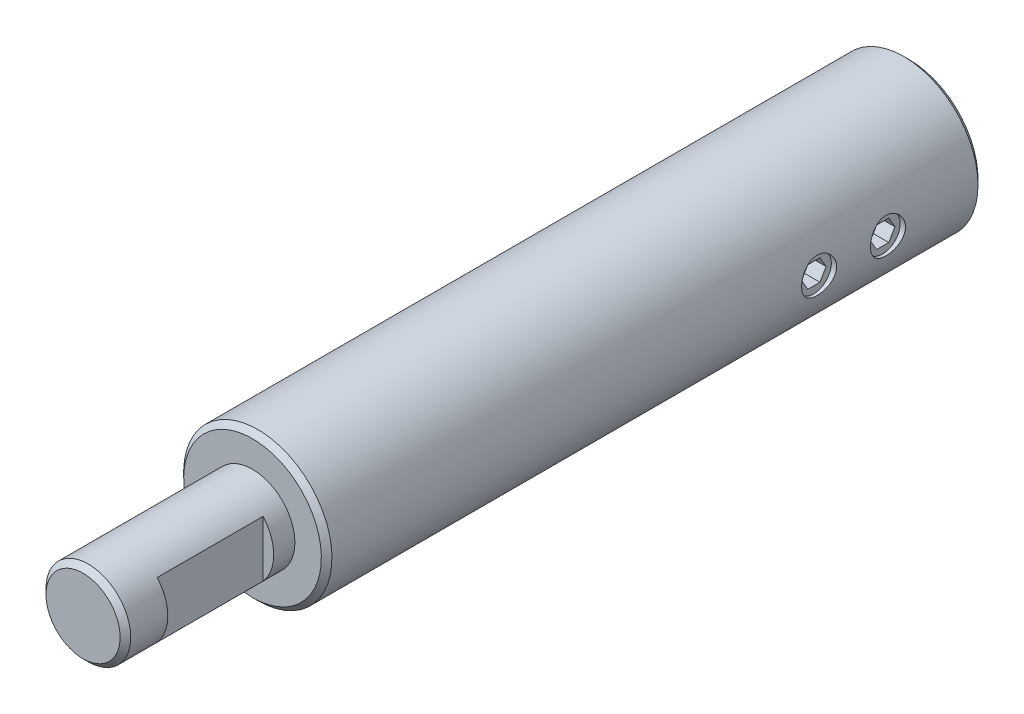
ISO-10303-21;
HEADER;
FILE_DESCRIPTION(('STEP AP214'),'2;1');
FILE_NAME('part.step','',(''),(''),'','','');
FILE_SCHEMA(('AUTOMOTIVE_DESIGN { 1 0 10303 214 1 1 1 1 }'));
ENDSEC;
DATA;
#1=APPLICATION_CONTEXT('core data for automotive mechanical design processes');
#2=APPLICATION_PROTOCOL_DEFINITION('international standard','automotive_design',2000,#1);
#3=PRODUCT_CONTEXT('',#1,'mechanical');
#4=PRODUCT('Part','Part','',(#3));
#5=PRODUCT_RELATED_PRODUCT_CATEGORY('part','',(#4));
#6=PRODUCT_DEFINITION_FORMATION('','',#4);
#7=PRODUCT_DEFINITION_CONTEXT('part definition',#1,'design');
#8=PRODUCT_DEFINITION('design','',#6,#7);
#9=PRODUCT_DEFINITION_SHAPE('','',#8);
#10=(LENGTH_UNIT() NAMED_UNIT(*) SI_UNIT(.MILLI.,.METRE.));
#11=(NAMED_UNIT(*) PLANE_ANGLE_UNIT() SI_UNIT($,.RADIAN.));
#12=(NAMED_UNIT(*) SI_UNIT($,.STERADIAN.) SOLID_ANGLE_UNIT());
#13=UNCERTAINTY_MEASURE_WITH_UNIT(LENGTH_MEASURE(1.E-05),#10,'distance_accuracy_value','');
#14=(GEOMETRIC_REPRESENTATION_CONTEXT(3) GLOBAL_UNCERTAINTY_ASSIGNED_CONTEXT((#13)) GLOBAL_UNIT_ASSIGNED_CONTEXT((#10,
#11,#12)) REPRESENTATION_CONTEXT('',''));
#15=CARTESIAN_POINT('',(0.,0.,0.));
#16=DIRECTION('',(0.,0.,1.));
#17=DIRECTION('',(1.,0.,0.));
#18=AXIS2_PLACEMENT_3D('',#15,#16,#17);
#19=CARTESIAN_POINT('',(5.,0.,10.1547005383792));
#20=DIRECTION('',(1.,0.,0.));
#21=DIRECTION('',(0.,1.,0.));
#22=AXIS2_PLACEMENT_3D('',#19,#20,#21);
#23=PLANE('',#22);
#24=DIRECTION('',(0.,-0.866025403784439,0.5));
#25=VECTOR('',#24,1.);
#26=CARTESIAN_POINT('',(5.,1.,9.57735026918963));
#27=LINE('',#26,#25);
#28=CARTESIAN_POINT('',(5.,1.,9.57735026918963));
#29=VERTEX_POINT('',#28);
#30=CARTESIAN_POINT('',(5.,0.,10.1547005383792));
#31=VERTEX_POINT('',#30);
#32=EDGE_CURVE('E189',#29,#31,#27,.T.);
#33=ORIENTED_EDGE('',*,*,#32,.T.);
#34=DIRECTION('',(0.,-0.866025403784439,-0.5));
#35=VECTOR('',#34,1.);
#36=CARTESIAN_POINT('',(5.,0.,10.1547005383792));
#37=LINE('',#36,#35);
#38=CARTESIAN_POINT('',(5.,-1.,9.57735026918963));
#39=VERTEX_POINT('',#38);
#40=EDGE_CURVE('E722',#31,#39,#37,.T.);
#41=ORIENTED_EDGE('',*,*,#40,.T.);
#42=DIRECTION('',(0.,0.,-1.));
#43=VECTOR('',#42,1.);
#44=CARTESIAN_POINT('',(5.,-1.,9.57735026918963));
#45=LINE('',#44,#43);
#46=CARTESIAN_POINT('',(5.,-1.,8.42264973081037));
#47=VERTEX_POINT('',#46);
#48=EDGE_CURVE('E725',#39,#47,#45,.T.);
#49=ORIENTED_EDGE('',*,*,#48,.T.);
#50=DIRECTION('',(0.,0.866025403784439,-0.5));
#51=VECTOR('',#50,1.);
#52=CARTESIAN_POINT('',(5.,-1.,8.42264973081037));
#53=LINE('',#52,#51);
#54=CARTESIAN_POINT('',(5.,0.,7.84529946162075));
#55=VERTEX_POINT('',#54);
#56=EDGE_CURVE('E728',#47,#55,#53,.T.);
#57=ORIENTED_EDGE('',*,*,#56,.T.);
#58=DIRECTION('',(0.,0.866025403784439,0.5));
#59=VECTOR('',#58,1.);
#60=CARTESIAN_POINT('',(5.,0.,7.84529946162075));
#61=LINE('',#60,#59);
#62=CARTESIAN_POINT('',(5.,1.,8.42264973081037));
#63=VERTEX_POINT('',#62);
#64=EDGE_CURVE('E730',#55,#63,#61,.T.);
#65=ORIENTED_EDGE('',*,*,#64,.T.);
#66=DIRECTION('',(0.,0.,1.));
#67=VECTOR('',#66,1.);
#68=CARTESIAN_POINT('',(5.,1.,8.42264973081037));
#69=LINE('',#68,#67);
#70=EDGE_CURVE('E175',#63,#29,#69,.T.);
#71=ORIENTED_EDGE('',*,*,#70,.T.);
#72=EDGE_LOOP('',(#33,#41,#49,#57,#65,#71));
#73=FACE_BOUND('',#72,.T.);
#74=ADVANCED_FACE('F14',(#73),#23,.T.);
#75=CARTESIAN_POINT('',(5.,0.,10.1547005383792));
#76=DIRECTION('',(0.,-0.5,0.866025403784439));
#77=DIRECTION('',(0.,-0.866025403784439,-0.5));
#78=AXIS2_PLACEMENT_3D('',#75,#76,#77);
#79=PLANE('',#78);
#80=DIRECTION('',(0.,-0.866025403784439,-0.5));
#81=VECTOR('',#80,1.);
#82=CARTESIAN_POINT('',(6.5,0.,10.1547005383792));
#83=LINE('',#82,#81);
#84=CARTESIAN_POINT('',(6.5,0.,10.1547005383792));
#85=VERTEX_POINT('',#84);
#86=CARTESIAN_POINT('',(6.5,-1.,9.57735026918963));
#87=VERTEX_POINT('',#86);
#88=EDGE_CURVE('E166',#85,#87,#83,.T.);
#89=ORIENTED_EDGE('',*,*,#88,.T.);
#90=DIRECTION('',(1.,0.,0.));
#91=VECTOR('',#90,1.);
#92=CARTESIAN_POINT('',(5.,-1.,9.57735026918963));
#93=LINE('',#92,#91);
#94=EDGE_CURVE('E199',#39,#87,#93,.T.);
#95=ORIENTED_EDGE('',*,*,#94,.F.);
#96=ORIENTED_EDGE('',*,*,#40,.F.);
#97=DIRECTION('',(1.,0.,0.));
#98=VECTOR('',#97,1.);
#99=CARTESIAN_POINT('',(5.,0.,10.1547005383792));
#100=LINE('',#99,#98);
#101=EDGE_CURVE('E201',#31,#85,#100,.T.);
#102=ORIENTED_EDGE('',*,*,#101,.T.);
#103=EDGE_LOOP('',(#89,#95,#96,#102));
#104=FACE_BOUND('',#103,.T.);
#105=ADVANCED_FACE('F284',(#104),#79,.F.);
#106=CARTESIAN_POINT('',(5.,-1.,9.57735026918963));
#107=DIRECTION('',(0.,-1.,0.));
#108=DIRECTION('',(1.,0.,0.));
#109=AXIS2_PLACEMENT_3D('',#106,#107,#108);
#110=PLANE('',#109);
#111=DIRECTION('',(0.,0.,-1.));
#112=VECTOR('',#111,1.);
#113=CARTESIAN_POINT('',(6.5,-1.,9.57735026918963));
#114=LINE('',#113,#112);
#115=CARTESIAN_POINT('',(6.5,-1.,8.42264973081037));
#116=VERTEX_POINT('',#115);
#117=EDGE_CURVE('E172',#87,#116,#114,.T.);
#118=ORIENTED_EDGE('',*,*,#117,.T.);
#119=DIRECTION('',(1.,0.,0.));
#120=VECTOR('',#119,1.);
#121=CARTESIAN_POINT('',(5.,-1.,8.42264973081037));
#122=LINE('',#121,#120);
#123=EDGE_CURVE('E197',#47,#116,#122,.T.);
#124=ORIENTED_EDGE('',*,*,#123,.F.);
#125=ORIENTED_EDGE('',*,*,#48,.F.);
#126=ORIENTED_EDGE('',*,*,#94,.T.);
#127=EDGE_LOOP('',(#118,#124,#125,#126));
#128=FACE_BOUND('',#127,.T.);
#129=ADVANCED_FACE('F299',(#128),#110,.F.);
#130=CARTESIAN_POINT('',(5.,-1.,8.42264973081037));
#131=DIRECTION('',(0.,-0.5,-0.866025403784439));
#132=DIRECTION('',(0.,0.866025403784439,-0.5));
#133=AXIS2_PLACEMENT_3D('',#130,#131,#132);
#134=PLANE('',#133);
#135=DIRECTION('',(0.,0.866025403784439,-0.5));
#136=VECTOR('',#135,1.);
#137=CARTESIAN_POINT('',(6.5,-1.,8.42264973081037));
#138=LINE('',#137,#136);
#139=CARTESIAN_POINT('',(6.5,0.,7.84529946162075));
#140=VERTEX_POINT('',#139);
#141=EDGE_CURVE('E180',#116,#140,#138,.T.);
#142=ORIENTED_EDGE('',*,*,#141,.T.);
#143=DIRECTION('',(1.,0.,0.));
#144=VECTOR('',#143,1.);
#145=CARTESIAN_POINT('',(5.,0.,7.84529946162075));
#146=LINE('',#145,#144);
#147=EDGE_CURVE('E195',#55,#140,#146,.T.);
#148=ORIENTED_EDGE('',*,*,#147,.F.);
#149=ORIENTED_EDGE('',*,*,#56,.F.);
#150=ORIENTED_EDGE('',*,*,#123,.T.);
#151=EDGE_LOOP('',(#142,#148,#149,#150));
#152=FACE_BOUND('',#151,.T.);
#153=ADVANCED_FACE('F295',(#152),#134,.F.);
#154=CARTESIAN_POINT('',(5.,0.,7.84529946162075));
#155=DIRECTION('',(0.,0.5,-0.866025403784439));
#156=DIRECTION('',(0.,0.866025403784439,0.5));
#157=AXIS2_PLACEMENT_3D('',#154,#155,#156);
#158=PLANE('',#157);
#159=DIRECTION('',(0.,0.866025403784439,0.5));
#160=VECTOR('',#159,1.);
#161=CARTESIAN_POINT('',(6.5,0.,7.84529946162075));
#162=LINE('',#161,#160);
#163=CARTESIAN_POINT('',(6.5,1.,8.42264973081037));
#164=VERTEX_POINT('',#163);
#165=EDGE_CURVE('E183',#140,#164,#162,.T.);
#166=ORIENTED_EDGE('',*,*,#165,.T.);
#167=DIRECTION('',(1.,0.,0.));
#168=VECTOR('',#167,1.);
#169=CARTESIAN_POINT('',(5.,1.,8.42264973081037));
#170=LINE('',#169,#168);
#171=EDGE_CURVE('E193',#63,#164,#170,.T.);
#172=ORIENTED_EDGE('',*,*,#171,.F.);
#173=ORIENTED_EDGE('',*,*,#64,.F.);
#174=ORIENTED_EDGE('',*,*,#147,.T.);
#175=EDGE_LOOP('',(#166,#172,#173,#174));
#176=FACE_BOUND('',#175,.T.);
#177=ADVANCED_FACE('F291',(#176),#158,.F.);
#178=CARTESIAN_POINT('',(5.,1.,8.42264973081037));
#179=DIRECTION('',(0.,1.,0.));
#180=DIRECTION('',(-1.,0.,0.));
#181=AXIS2_PLACEMENT_3D('',#178,#179,#180);
#182=PLANE('',#181);
#183=DIRECTION('',(0.,0.,1.));
#184=VECTOR('',#183,1.);
#185=CARTESIAN_POINT('',(6.5,1.,8.42264973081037));
#186=LINE('',#185,#184);
#187=CARTESIAN_POINT('',(6.5,1.,9.57735026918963));
#188=VERTEX_POINT('',#187);
#189=EDGE_CURVE('E186',#164,#188,#186,.T.);
#190=ORIENTED_EDGE('',*,*,#189,.T.);
#191=DIRECTION('',(1.,0.,0.));
#192=VECTOR('',#191,1.);
#193=CARTESIAN_POINT('',(5.,1.,9.57735026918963));
#194=LINE('',#193,#192);
#195=EDGE_CURVE('E190',#29,#188,#194,.T.);
#196=ORIENTED_EDGE('',*,*,#195,.F.);
#197=ORIENTED_EDGE('',*,*,#70,.F.);
#198=ORIENTED_EDGE('',*,*,#171,.T.);
#199=EDGE_LOOP('',(#190,#196,#197,#198));
#200=FACE_BOUND('',#199,.T.);
#201=ADVANCED_FACE('F287',(#200),#182,.F.);
#202=CARTESIAN_POINT('',(5.,1.,9.57735026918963));
#203=DIRECTION('',(0.,0.5,0.866025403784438));
#204=DIRECTION('',(0.,-0.866025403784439,0.5));
#205=AXIS2_PLACEMENT_3D('',#202,#203,#204);
#206=PLANE('',#205);
#207=DIRECTION('',(0.,-0.866025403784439,0.5));
#208=VECTOR('',#207,1.);
#209=CARTESIAN_POINT('',(6.5,1.,9.57735026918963));
#210=LINE('',#209,#208);
#211=EDGE_CURVE('E163',#188,#85,#210,.T.);
#212=ORIENTED_EDGE('',*,*,#211,.T.);
#213=ORIENTED_EDGE('',*,*,#101,.F.);
#214=ORIENTED_EDGE('',*,*,#32,.F.);
#215=ORIENTED_EDGE('',*,*,#195,.T.);
#216=EDGE_LOOP('',(#212,#213,#214,#215));
#217=FACE_BOUND('',#216,.T.);
#218=ADVANCED_FACE('F290',(#217),#206,.F.);
#219=CARTESIAN_POINT('',(6.5,0.,11.));
#220=DIRECTION('',(1.,0.,0.));
#221=DIRECTION('',(0.,0.,-1.));
#222=AXIS2_PLACEMENT_3D('',#219,#220,#221);
#223=PLANE('',#222);
#224=ORIENTED_EDGE('',*,*,#211,.F.);
#225=ORIENTED_EDGE('',*,*,#189,.F.);
#226=ORIENTED_EDGE('',*,*,#165,.F.);
#227=ORIENTED_EDGE('',*,*,#141,.F.);
#228=ORIENTED_EDGE('',*,*,#117,.F.);
#229=ORIENTED_EDGE('',*,*,#88,.F.);
#230=EDGE_LOOP('',(#224,#225,#226,#227,#228,#229));
#231=FACE_BOUND('',#230,.T.);
#232=CARTESIAN_POINT('',(6.5,0.,9.));
#233=DIRECTION('',(1.,0.,0.));
#234=DIRECTION('',(0.,1.,0.));
#235=AXIS2_PLACEMENT_3D('',#232,#233,#234);
#236=CIRCLE('',#235,1.65);
#237=CARTESIAN_POINT('',(6.5,1.65,9.));
#238=VERTEX_POINT('',#237);
#239=EDGE_CURVE('E391',#238,#238,#236,.F.);
#240=ORIENTED_EDGE('',*,*,#239,.F.);
#241=EDGE_LOOP('',(#240));
#242=FACE_BOUND('',#241,.T.);
#243=ADVANCED_FACE('F309',(#231,#242),#223,.T.);
#244=CARTESIAN_POINT('',(2.5,0.,9.));
#245=DIRECTION('',(-1.,0.,0.));
#246=DIRECTION('',(0.,0.,1.));
#247=AXIS2_PLACEMENT_3D('',#244,#245,#246);
#248=CYLINDRICAL_SURFACE('',#247,2.);
#249=CARTESIAN_POINT('',(3.25,0.,9.));
#250=DIRECTION('',(-1.,0.,0.));
#251=DIRECTION('',(0.,0.,1.));
#252=AXIS2_PLACEMENT_3D('',#249,#250,#251);
#253=CIRCLE('',#252,2.);
#254=CARTESIAN_POINT('',(3.25,0.,11.));
#255=VERTEX_POINT('',#254);
#256=EDGE_CURVE('E192',#255,#255,#253,.T.);
#257=ORIENTED_EDGE('',*,*,#256,.F.);
#258=EDGE_LOOP('',(#257));
#259=FACE_BOUND('',#258,.T.);
#260=CARTESIAN_POINT('',(4.,0.,11.));
#261=CARTESIAN_POINT('',(3.99999426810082,-0.105143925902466,10.9999933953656));
#262=CARTESIAN_POINT('',(3.99580982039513,-0.210413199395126,10.9916598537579));
#263=CARTESIAN_POINT('',(3.97948312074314,-0.417840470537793,10.9586942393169));
#264=CARTESIAN_POINT('',(3.96732575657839,-0.519992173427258,10.9340312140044));
#265=CARTESIAN_POINT('',(3.93632558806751,-0.717867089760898,10.8696123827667));
#266=CARTESIAN_POINT('',(3.91750878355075,-0.813613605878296,10.8299152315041));
#267=CARTESIAN_POINT('',(3.87491553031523,-0.996945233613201,10.73685875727));
#268=CARTESIAN_POINT('',(3.85113947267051,-1.08453098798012,10.6835005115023));
#269=CARTESIAN_POINT('',(3.79912516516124,-1.25501563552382,10.5609655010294));
#270=CARTESIAN_POINT('',(3.77070398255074,-1.33731042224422,10.4910270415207));
#271=CARTESIAN_POINT('',(3.71319940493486,-1.48955888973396,10.3389570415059));
#272=CARTESIAN_POINT('',(3.68411552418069,-1.55950316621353,10.2568162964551));
#273=CARTESIAN_POINT('',(3.62597902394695,-1.69050400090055,10.0750333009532));
#274=CARTESIAN_POINT('',(3.59710373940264,-1.75045067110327,9.97452780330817));
#275=CARTESIAN_POINT('',(3.54571957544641,-1.85233645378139,9.76326532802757));
#276=CARTESIAN_POINT('',(3.52320615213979,-1.89428842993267,9.6525157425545));
#277=CARTESIAN_POINT('',(3.48915734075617,-1.95626488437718,9.43066978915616));
#278=CARTESIAN_POINT('',(3.47704543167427,-1.97745171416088,9.31999109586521));
#279=CARTESIAN_POINT('',(3.46363779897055,-2.00085398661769,9.09604232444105));
#280=CARTESIAN_POINT('',(3.46233138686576,-2.00308817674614,8.98277491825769));
#281=CARTESIAN_POINT('',(3.47021860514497,-1.98937457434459,8.77142795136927));
#282=CARTESIAN_POINT('',(3.47817527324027,-1.97556911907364,8.6731519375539));
#283=CARTESIAN_POINT('',(3.50152457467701,-1.93387969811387,8.48055618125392));
#284=CARTESIAN_POINT('',(3.51691957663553,-1.9059912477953,8.38623770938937));
#285=CARTESIAN_POINT('',(3.55374952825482,-1.83641956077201,8.20154173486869));
#286=CARTESIAN_POINT('',(3.57531681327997,-1.79443013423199,8.11130720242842));
#287=CARTESIAN_POINT('',(3.62206808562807,-1.69808337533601,7.93873141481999));
#288=CARTESIAN_POINT('',(3.64725369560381,-1.64372048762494,7.85639372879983));
#289=CARTESIAN_POINT('',(3.70226315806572,-1.51613210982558,7.69095749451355));
#290=CARTESIAN_POINT('',(3.73227020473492,-1.44138891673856,7.60908625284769));
#291=CARTESIAN_POINT('',(3.79095246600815,-1.27911115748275,7.4585291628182));
#292=CARTESIAN_POINT('',(3.81962703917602,-1.19157051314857,7.38984961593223));
#293=CARTESIAN_POINT('',(3.87403974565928,-1.0010330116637,7.26462867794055));
#294=CARTESIAN_POINT('',(3.89957968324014,-0.897507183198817,7.20879905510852));
#295=CARTESIAN_POINT('',(3.94315762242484,-0.680932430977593,7.11580594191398));
#296=CARTESIAN_POINT('',(3.96120157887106,-0.567891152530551,7.07862762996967));
#297=CARTESIAN_POINT('',(3.98648667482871,-0.345532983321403,7.02704919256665));
#298=CARTESIAN_POINT('',(3.9944987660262,-0.236683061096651,7.01101752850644));
#299=CARTESIAN_POINT('',(4.00146026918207,-0.0175591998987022,6.99707053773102));
#300=CARTESIAN_POINT('',(4.00041397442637,0.0927140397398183,6.99914662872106));
#301=CARTESIAN_POINT('',(3.9898238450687,0.302465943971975,7.02041337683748));
#302=CARTESIAN_POINT('',(3.98094491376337,0.402118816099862,7.03826506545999));
#303=CARTESIAN_POINT('',(3.9564434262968,0.596813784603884,7.08847614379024));
#304=CARTESIAN_POINT('',(3.94082012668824,0.691855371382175,7.12083713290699));
#305=CARTESIAN_POINT('',(3.90368502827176,0.877777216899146,7.19999693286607));
#306=CARTESIAN_POINT('',(3.88201763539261,0.968460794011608,7.24718210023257));
#307=CARTESIAN_POINT('',(3.83487948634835,1.14092272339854,7.35421507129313));
#308=CARTESIAN_POINT('',(3.80940711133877,1.22269725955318,7.41406826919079));
#309=CARTESIAN_POINT('',(3.75416442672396,1.38353537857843,7.55152085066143));
#310=CARTESIAN_POINT('',(3.72421769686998,1.46154415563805,7.63028573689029));
#311=CARTESIAN_POINT('',(3.6652478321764,1.60371264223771,7.79985030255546));
#312=CARTESIAN_POINT('',(3.63622534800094,1.66786277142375,7.89065823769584));
#313=CARTESIAN_POINT('',(3.58102384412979,1.78341582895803,8.08728730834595));
#314=CARTESIAN_POINT('',(3.55505059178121,1.8340509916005,8.19362253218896));
#315=CARTESIAN_POINT('',(3.51148144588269,1.91616565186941,8.41502013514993));
#316=CARTESIAN_POINT('',(3.493874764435,1.94766983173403,8.53007105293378));
#317=CARTESIAN_POINT('',(3.47123002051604,1.98772337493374,8.75382044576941));
#318=CARTESIAN_POINT('',(3.4651476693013,1.9981859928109,8.86206850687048));
#319=CARTESIAN_POINT('',(3.46330709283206,2.00137830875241,9.07889413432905));
#320=CARTESIAN_POINT('',(3.4675443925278,1.99411569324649,9.18747153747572));
#321=CARTESIAN_POINT('',(3.48475724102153,1.96385225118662,9.39096700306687));
#322=CARTESIAN_POINT('',(3.49686188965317,1.94241662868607,9.48620094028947));
#323=CARTESIAN_POINT('',(3.52742032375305,1.88635071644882,9.67161623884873));
#324=CARTESIAN_POINT('',(3.54587615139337,1.85171618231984,9.76179596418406));
#325=CARTESIAN_POINT('',(3.58857060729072,1.76763149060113,9.94124970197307));
#326=CARTESIAN_POINT('',(3.61311444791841,1.7173422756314,10.0300558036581));
#327=CARTESIAN_POINT('',(3.66470663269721,1.60430194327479,10.1985490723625));
#328=CARTESIAN_POINT('',(3.69175627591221,1.54154434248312,10.2782314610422));
#329=CARTESIAN_POINT('',(3.74924646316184,1.39640665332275,10.4362839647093));
#330=CARTESIAN_POINT('',(3.77969966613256,1.31256884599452,10.5133182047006));
#331=CARTESIAN_POINT('',(3.83755504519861,1.1323096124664,10.6525259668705));
#332=CARTESIAN_POINT('',(3.8649555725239,1.0358814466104,10.7146914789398));
#333=CARTESIAN_POINT('',(3.91396019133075,0.83186319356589,10.8224727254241));
#334=CARTESIAN_POINT('',(3.93552192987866,0.724199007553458,10.8679683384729));
#335=CARTESIAN_POINT('',(3.97002682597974,0.501484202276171,10.9396163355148));
#336=CARTESIAN_POINT('',(3.98299446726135,0.386455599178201,10.9658236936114));
#337=CARTESIAN_POINT('',(3.99390923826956,0.225203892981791,10.9877948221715));
#338=CARTESIAN_POINT('',(3.99618730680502,0.180323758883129,10.9923652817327));
#339=CARTESIAN_POINT('',(3.99923393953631,0.0903034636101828,10.9984693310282));
#340=CARTESIAN_POINT('',(4.00000246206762,0.0451632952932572,11.0000028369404));
#341=CARTESIAN_POINT('',(4.,0.,11.));
#342=B_SPLINE_CURVE_WITH_KNOTS('',3,(#260,#261,#262,#263,#264,#265,#266,#267,#268,#269,#270,
#271,#272,#273,#274,#275,#276,#277,#278,#279,#280,#281,#282,#283,#284,#285,#286,#287,#288,#289,
#290,#291,#292,#293,#294,#295,#296,#297,#298,#299,#300,#301,#302,#303,#304,#305,#306,#307,#308,
#309,#310,#311,#312,#313,#314,#315,#316,#317,#318,#319,#320,#321,#322,#323,#324,#325,#326,#327,
#328,#329,#330,#331,#332,#333,#334,#335,#336,#337,#338,#339,#340,#341),.UNSPECIFIED.,.T.,.F.,(4,
2,2,2,2,2,2,2,2,2,2,2,2,2,2,2,2,2,2,2,2,2,2,2,2,2,2,2,2,2,2,2,2,2,2,2,2,2,2,2,4),(0.,
0.315248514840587,0.631096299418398,0.9457243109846,1.26032752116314,1.59396351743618,
1.92785247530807,2.28763452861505,2.64715895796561,2.98516024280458,3.3228271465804,
3.6201142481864,3.91749607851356,4.22180480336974,4.52625042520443,4.86929882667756,
5.21251069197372,5.57166044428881,5.93052433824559,6.25966580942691,6.58865129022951,
6.89213813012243,7.19565843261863,7.50785712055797,7.82018901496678,8.16319221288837,
8.50643177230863,8.86629364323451,9.22569023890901,9.55058615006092,9.87534119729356,
10.1691586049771,10.463070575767,10.7767291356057,11.0905512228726,11.4425048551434,
11.7946476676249,12.1492802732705,12.502898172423,12.6383056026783,12.7737167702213),.UNSPECIFIED.);
#343=CARTESIAN_POINT('',(4.,0.,11.));
#344=VERTEX_POINT('',#343);
#345=EDGE_CURVE('E9',#344,#344,#342,.T.);
#346=ORIENTED_EDGE('',*,*,#345,.F.);
#347=EDGE_LOOP('',(#346));
#348=FACE_BOUND('',#347,.T.);
#349=ADVANCED_FACE('F256',(#259,#348),#248,.T.);
#350=CARTESIAN_POINT('',(2.5,0.,9.));
#351=DIRECTION('',(-1.,0.,0.));
#352=DIRECTION('',(0.,0.,1.));
#353=AXIS2_PLACEMENT_3D('',#350,#351,#352);
#354=PLANE('',#353);
#355=CARTESIAN_POINT('',(2.5,0.,9.));
#356=DIRECTION('',(-1.,0.,0.));
#357=DIRECTION('',(0.,0.,1.));
#358=AXIS2_PLACEMENT_3D('',#355,#356,#357);
#359=CIRCLE('',#358,1.25);
#360=CARTESIAN_POINT('',(2.5,0.,10.25));
#361=VERTEX_POINT('',#360);
#362=EDGE_CURVE('E205',#361,#361,#359,.T.);
#363=ORIENTED_EDGE('',*,*,#362,.T.);
#364=EDGE_LOOP('',(#363));
#365=FACE_BOUND('',#364,.T.);
#366=ADVANCED_FACE('F316',(#365),#354,.T.);
#367=CARTESIAN_POINT('',(2.5,0.,9.));
#368=DIRECTION('',(1.,0.,0.));
#369=DIRECTION('',(0.,0.,-1.));
#370=AXIS2_PLACEMENT_3D('',#367,#368,#369);
#371=CONICAL_SURFACE('',#370,1.25,0.78539816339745);
#372=ORIENTED_EDGE('',*,*,#256,.T.);
#373=EDGE_LOOP('',(#372));
#374=FACE_BOUND('',#373,.T.);
#375=ORIENTED_EDGE('',*,*,#362,.F.);
#376=EDGE_LOOP('',(#375));
#377=FACE_BOUND('',#376,.T.);
#378=ADVANCED_FACE('F318',(#374,#377),#371,.T.);
#379=CARTESIAN_POINT('',(5.,-1.,14.9226497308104));
#380=DIRECTION('',(1.,0.,0.));
#381=DIRECTION('',(0.,-0.5,0.866025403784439));
#382=AXIS2_PLACEMENT_3D('',#379,#380,#381);
#383=PLANE('',#382);
#384=DIRECTION('',(0.,0.,-1.));
#385=VECTOR('',#384,1.);
#386=CARTESIAN_POINT('',(5.,-1.,16.0773502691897));
#387=LINE('',#386,#385);
#388=CARTESIAN_POINT('',(5.,-1.,16.0773502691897));
#389=VERTEX_POINT('',#388);
#390=CARTESIAN_POINT('',(5.,-1.,14.9226497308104));
#391=VERTEX_POINT('',#390);
#392=EDGE_CURVE('E117',#389,#391,#387,.T.);
#393=ORIENTED_EDGE('',*,*,#392,.T.);
#394=DIRECTION('',(0.,0.866025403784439,-0.5));
#395=VECTOR('',#394,1.);
#396=CARTESIAN_POINT('',(5.,-1.,14.9226497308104));
#397=LINE('',#396,#395);
#398=CARTESIAN_POINT('',(5.,0.,14.3452994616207));
#399=VERTEX_POINT('',#398);
#400=EDGE_CURVE('E210',#391,#399,#397,.T.);
#401=ORIENTED_EDGE('',*,*,#400,.T.);
#402=DIRECTION('',(0.,0.866025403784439,0.5));
#403=VECTOR('',#402,1.);
#404=CARTESIAN_POINT('',(5.,0.,14.3452994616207));
#405=LINE('',#404,#403);
#406=CARTESIAN_POINT('',(5.,1.,14.9226497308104));
#407=VERTEX_POINT('',#406);
#408=EDGE_CURVE('E213',#399,#407,#405,.T.);
#409=ORIENTED_EDGE('',*,*,#408,.T.);
#410=DIRECTION('',(0.,0.,1.));
#411=VECTOR('',#410,1.);
#412=CARTESIAN_POINT('',(5.,1.,14.9226497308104));
#413=LINE('',#412,#411);
#414=CARTESIAN_POINT('',(5.,1.,16.0773502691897));
#415=VERTEX_POINT('',#414);
#416=EDGE_CURVE('E216',#407,#415,#413,.T.);
#417=ORIENTED_EDGE('',*,*,#416,.T.);
#418=DIRECTION('',(0.,-0.866025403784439,0.5));
#419=VECTOR('',#418,1.);
#420=CARTESIAN_POINT('',(5.,1.,16.0773502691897));
#421=LINE('',#420,#419);
#422=CARTESIAN_POINT('',(5.,0.,16.6547005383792));
#423=VERTEX_POINT('',#422);
#424=EDGE_CURVE('E218',#415,#423,#421,.T.);
#425=ORIENTED_EDGE('',*,*,#424,.T.);
#426=DIRECTION('',(0.,-0.866025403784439,-0.5));
#427=VECTOR('',#426,1.);
#428=CARTESIAN_POINT('',(5.,0.,16.6547005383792));
#429=LINE('',#428,#427);
#430=EDGE_CURVE('E142',#423,#389,#429,.T.);
#431=ORIENTED_EDGE('',*,*,#430,.T.);
#432=EDGE_LOOP('',(#393,#401,#409,#417,#425,#431));
#433=FACE_BOUND('',#432,.T.);
#434=ADVANCED_FACE('F222',(#433),#383,.T.);
#435=CARTESIAN_POINT('',(5.,-1.,14.9226497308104));
#436=DIRECTION('',(0.,-0.5,-0.866025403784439));
#437=DIRECTION('',(0.,0.866025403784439,-0.5));
#438=AXIS2_PLACEMENT_3D('',#435,#436,#437);
#439=PLANE('',#438);
#440=DIRECTION('',(0.,0.866025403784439,-0.5));
#441=VECTOR('',#440,1.);
#442=CARTESIAN_POINT('',(6.5,-1.,14.9226497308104));
#443=LINE('',#442,#441);
#444=CARTESIAN_POINT('',(6.5,-1.,14.9226497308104));
#445=VERTEX_POINT('',#444);
#446=CARTESIAN_POINT('',(6.5,0.,14.3452994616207));
#447=VERTEX_POINT('',#446);
#448=EDGE_CURVE('E137',#445,#447,#443,.T.);
#449=ORIENTED_EDGE('',*,*,#448,.T.);
#450=DIRECTION('',(1.,0.,0.));
#451=VECTOR('',#450,1.);
#452=CARTESIAN_POINT('',(5.,0.,14.3452994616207));
#453=LINE('',#452,#451);
#454=EDGE_CURVE('E156',#399,#447,#453,.T.);
#455=ORIENTED_EDGE('',*,*,#454,.F.);
#456=ORIENTED_EDGE('',*,*,#400,.F.);
#457=DIRECTION('',(1.,0.,0.));
#458=VECTOR('',#457,1.);
#459=CARTESIAN_POINT('',(5.,-1.,14.9226497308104));
#460=LINE('',#459,#458);
#461=EDGE_CURVE('E158',#391,#445,#460,.T.);
#462=ORIENTED_EDGE('',*,*,#461,.T.);
#463=EDGE_LOOP('',(#449,#455,#456,#462));
#464=FACE_BOUND('',#463,.T.);
#465=ADVANCED_FACE('F226',(#464),#439,.F.);
#466=CARTESIAN_POINT('',(5.,0.,14.3452994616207));
#467=DIRECTION('',(0.,0.5,-0.866025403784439));
#468=DIRECTION('',(1.,0.,0.));
#469=AXIS2_PLACEMENT_3D('',#466,#467,#468);
#470=PLANE('',#469);
#471=DIRECTION('',(0.,0.866025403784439,0.5));
#472=VECTOR('',#471,1.);
#473=CARTESIAN_POINT('',(6.5,0.,14.3452994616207));
#474=LINE('',#473,#472);
#475=CARTESIAN_POINT('',(6.5,1.,14.9226497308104));
#476=VERTEX_POINT('',#475);
#477=EDGE_CURVE('E139',#447,#476,#474,.T.);
#478=ORIENTED_EDGE('',*,*,#477,.T.);
#479=DIRECTION('',(1.,0.,0.));
#480=VECTOR('',#479,1.);
#481=CARTESIAN_POINT('',(5.,1.,14.9226497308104));
#482=LINE('',#481,#480);
#483=EDGE_CURVE('E154',#407,#476,#482,.T.);
#484=ORIENTED_EDGE('',*,*,#483,.F.);
#485=ORIENTED_EDGE('',*,*,#408,.F.);
#486=ORIENTED_EDGE('',*,*,#454,.T.);
#487=EDGE_LOOP('',(#478,#484,#485,#486));
#488=FACE_BOUND('',#487,.T.);
#489=ADVANCED_FACE('F228',(#488),#470,.F.);
#490=CARTESIAN_POINT('',(5.,1.,14.9226497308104));
#491=DIRECTION('',(0.,1.,0.));
#492=DIRECTION('',(0.,0.,1.));
#493=AXIS2_PLACEMENT_3D('',#490,#491,#492);
#494=PLANE('',#493);
#495=DIRECTION('',(0.,0.,1.));
#496=VECTOR('',#495,1.);
#497=CARTESIAN_POINT('',(6.5,1.,14.9226497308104));
#498=LINE('',#497,#496);
#499=CARTESIAN_POINT('',(6.5,1.,16.0773502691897));
#500=VERTEX_POINT('',#499);
#501=EDGE_CURVE('E147',#476,#500,#498,.T.);
#502=ORIENTED_EDGE('',*,*,#501,.T.);
#503=DIRECTION('',(1.,0.,0.));
#504=VECTOR('',#503,1.);
#505=CARTESIAN_POINT('',(5.,1.,16.0773502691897));
#506=LINE('',#505,#504);
#507=EDGE_CURVE('E152',#415,#500,#506,.T.);
#508=ORIENTED_EDGE('',*,*,#507,.F.);
#509=ORIENTED_EDGE('',*,*,#416,.F.);
#510=ORIENTED_EDGE('',*,*,#483,.T.);
#511=EDGE_LOOP('',(#502,#508,#509,#510));
#512=FACE_BOUND('',#511,.T.);
#513=ADVANCED_FACE('F232',(#512),#494,.F.);
#514=CARTESIAN_POINT('',(5.,1.,16.0773502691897));
#515=DIRECTION('',(0.,0.5,0.866025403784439));
#516=DIRECTION('',(0.,-0.866025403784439,0.5));
#517=AXIS2_PLACEMENT_3D('',#514,#515,#516);
#518=PLANE('',#517);
#519=DIRECTION('',(0.,-0.866025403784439,0.5));
#520=VECTOR('',#519,1.);
#521=CARTESIAN_POINT('',(6.5,1.,16.0773502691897));
#522=LINE('',#521,#520);
#523=CARTESIAN_POINT('',(6.5,0.,16.6547005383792));
#524=VERTEX_POINT('',#523);
#525=EDGE_CURVE('E130',#500,#524,#522,.T.);
#526=ORIENTED_EDGE('',*,*,#525,.T.);
#527=DIRECTION('',(1.,0.,0.));
#528=VECTOR('',#527,1.);
#529=CARTESIAN_POINT('',(5.,0.,16.6547005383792));
#530=LINE('',#529,#528);
#531=EDGE_CURVE('E122',#423,#524,#530,.T.);
#532=ORIENTED_EDGE('',*,*,#531,.F.);
#533=ORIENTED_EDGE('',*,*,#424,.F.);
#534=ORIENTED_EDGE('',*,*,#507,.T.);
#535=EDGE_LOOP('',(#526,#532,#533,#534));
#536=FACE_BOUND('',#535,.T.);
#537=ADVANCED_FACE('F234',(#536),#518,.F.);
#538=CARTESIAN_POINT('',(5.,0.,16.6547005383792));
#539=DIRECTION('',(0.,-0.5,0.866025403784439));
#540=DIRECTION('',(-1.,0.,0.));
#541=AXIS2_PLACEMENT_3D('',#538,#539,#540);
#542=PLANE('',#541);
#543=DIRECTION('',(0.,-0.866025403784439,-0.5));
#544=VECTOR('',#543,1.);
#545=CARTESIAN_POINT('',(6.5,0.,16.6547005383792));
#546=LINE('',#545,#544);
#547=CARTESIAN_POINT('',(6.5,-1.,16.0773502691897));
#548=VERTEX_POINT('',#547);
#549=EDGE_CURVE('E125',#524,#548,#546,.T.);
#550=ORIENTED_EDGE('',*,*,#549,.T.);
#551=DIRECTION('',(1.,0.,0.));
#552=VECTOR('',#551,1.);
#553=CARTESIAN_POINT('',(5.,-1.,16.0773502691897));
#554=LINE('',#553,#552);
#555=EDGE_CURVE('E110',#389,#548,#554,.T.);
#556=ORIENTED_EDGE('',*,*,#555,.F.);
#557=ORIENTED_EDGE('',*,*,#430,.F.);
#558=ORIENTED_EDGE('',*,*,#531,.T.);
#559=EDGE_LOOP('',(#550,#556,#557,#558));
#560=FACE_BOUND('',#559,.T.);
#561=ADVANCED_FACE('F126',(#560),#542,.F.);
#562=CARTESIAN_POINT('',(5.,-1.,16.0773502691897));
#563=DIRECTION('',(0.,-1.,0.));
#564=DIRECTION('',(0.,0.,-1.));
#565=AXIS2_PLACEMENT_3D('',#562,#563,#564);
#566=PLANE('',#565);
#567=DIRECTION('',(0.,0.,-1.));
#568=VECTOR('',#567,1.);
#569=CARTESIAN_POINT('',(6.5,-1.,16.0773502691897));
#570=LINE('',#569,#568);
#571=EDGE_CURVE('E114',#548,#445,#570,.T.);
#572=ORIENTED_EDGE('',*,*,#571,.T.);
#573=ORIENTED_EDGE('',*,*,#461,.F.);
#574=ORIENTED_EDGE('',*,*,#392,.F.);
#575=ORIENTED_EDGE('',*,*,#555,.T.);
#576=EDGE_LOOP('',(#572,#573,#574,#575));
#577=FACE_BOUND('',#576,.T.);
#578=ADVANCED_FACE('F112',(#577),#566,.F.);
#579=CARTESIAN_POINT('',(6.5,-1.73205080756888,14.5));
#580=DIRECTION('',(1.,0.,0.));
#581=DIRECTION('',(0.,0.866025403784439,0.5));
#582=AXIS2_PLACEMENT_3D('',#579,#580,#581);
#583=PLANE('',#582);
#584=ORIENTED_EDGE('',*,*,#571,.F.);
#585=ORIENTED_EDGE('',*,*,#549,.F.);
#586=ORIENTED_EDGE('',*,*,#525,.F.);
#587=ORIENTED_EDGE('',*,*,#501,.F.);
#588=ORIENTED_EDGE('',*,*,#477,.F.);
#589=ORIENTED_EDGE('',*,*,#448,.F.);
#590=EDGE_LOOP('',(#584,#585,#586,#587,#588,#589));
#591=FACE_BOUND('',#590,.T.);
#592=CARTESIAN_POINT('',(6.5,0.,15.5));
#593=DIRECTION('',(1.,0.,0.));
#594=DIRECTION('',(0.,0.,1.));
#595=AXIS2_PLACEMENT_3D('',#592,#593,#594);
#596=CIRCLE('',#595,1.65);
#597=CARTESIAN_POINT('',(6.5,0.,17.15));
#598=VERTEX_POINT('',#597);
#599=EDGE_CURVE('E393',#598,#598,#596,.F.);
#600=ORIENTED_EDGE('',*,*,#599,.F.);
#601=EDGE_LOOP('',(#600));
#602=FACE_BOUND('',#601,.T.);
#603=ADVANCED_FACE('F133',(#591,#602),#583,.T.);
#604=CARTESIAN_POINT('',(2.5,0.,15.5));
#605=DIRECTION('',(-1.,0.,0.));
#606=DIRECTION('',(0.,-0.866025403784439,-0.5));
#607=AXIS2_PLACEMENT_3D('',#604,#605,#606);
#608=CYLINDRICAL_SURFACE('',#607,2.);
#609=CARTESIAN_POINT('',(3.25,0.,15.5));
#610=DIRECTION('',(-1.,0.,0.));
#611=DIRECTION('',(0.,-0.866025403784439,-0.5));
#612=AXIS2_PLACEMENT_3D('',#609,#610,#611);
#613=CIRCLE('',#612,2.);
#614=CARTESIAN_POINT('',(3.25,-1.73205080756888,14.5));
#615=VERTEX_POINT('',#614);
#616=EDGE_CURVE('E121',#615,#615,#613,.T.);
#617=ORIENTED_EDGE('',*,*,#616,.F.);
#618=EDGE_LOOP('',(#617));
#619=FACE_BOUND('',#618,.T.);
#620=CARTESIAN_POINT('',(3.60555127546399,-1.73205080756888,14.5));
#621=CARTESIAN_POINT('',(3.63330072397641,-1.6742839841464,14.3999492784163));
#622=CARTESIAN_POINT('',(3.66340889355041,-1.60804520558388,14.3052717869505));
#623=CARTESIAN_POINT('',(3.72473015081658,-1.46040741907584,14.1286809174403));
#624=CARTESIAN_POINT('',(3.75594606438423,-1.37896698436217,14.0468035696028));
#625=CARTESIAN_POINT('',(3.81605659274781,-1.20265571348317,13.8978365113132));
#626=CARTESIAN_POINT('',(3.84495025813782,-1.10777942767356,13.8307528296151));
#627=CARTESIAN_POINT('',(3.8972467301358,-0.906764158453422,13.713583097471));
#628=CARTESIAN_POINT('',(3.92065575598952,-0.800638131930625,13.6634777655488));
#629=CARTESIAN_POINT('',(3.9585333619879,-0.584425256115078,13.583973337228));
#630=CARTESIAN_POINT('',(3.97332921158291,-0.474679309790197,13.5538093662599));
#631=CARTESIAN_POINT('',(3.99370450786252,-0.250836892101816,13.5125375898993));
#632=CARTESIAN_POINT('',(3.99928959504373,-0.136743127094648,13.5014181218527));
#633=CARTESIAN_POINT('',(4.00052059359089,0.0805769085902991,13.498961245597));
#634=CARTESIAN_POINT('',(3.99707902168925,0.183782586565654,13.5058076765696));
#635=CARTESIAN_POINT('',(3.98250691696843,0.387363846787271,13.5351783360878));
#636=CARTESIAN_POINT('',(3.97137663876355,0.487739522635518,13.5577020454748));
#637=CARTESIAN_POINT('',(3.94266442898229,0.681856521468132,13.6171121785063));
#638=CARTESIAN_POINT('',(3.92515694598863,0.775660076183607,13.6538331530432));
#639=CARTESIAN_POINT('',(3.88520912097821,0.955865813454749,13.740363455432));
#640=CARTESIAN_POINT('',(3.86276744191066,1.04226598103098,13.7901763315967));
#641=CARTESIAN_POINT('',(3.812752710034,1.21304818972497,13.9062456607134));
#642=CARTESIAN_POINT('',(3.78490681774,1.29664921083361,13.9735328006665));
#643=CARTESIAN_POINT('',(3.72810667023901,1.45191920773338,14.1203750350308));
#644=CARTESIAN_POINT('',(3.69915157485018,1.52357890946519,14.1999395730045));
#645=CARTESIAN_POINT('',(3.64057503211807,1.65894331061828,14.3769158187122));
#646=CARTESIAN_POINT('',(3.61109645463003,1.72150029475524,14.4752592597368));
#647=CARTESIAN_POINT('',(3.55783946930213,1.82904300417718,14.6825566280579));
#648=CARTESIAN_POINT('',(3.53405805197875,1.87403801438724,14.7915049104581));
#649=CARTESIAN_POINT('',(3.49672204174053,1.94278435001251,15.0118752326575));
#650=CARTESIAN_POINT('',(3.48273910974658,1.96743518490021,15.1229400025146));
#651=CARTESIAN_POINT('',(3.46560346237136,1.9974778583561,15.348415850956));
#652=CARTESIAN_POINT('',(3.46243843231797,2.00289159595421,15.4628229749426));
#653=CARTESIAN_POINT('',(3.46715158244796,1.99470641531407,15.6764682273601));
#654=CARTESIAN_POINT('',(3.47371297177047,1.98337510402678,15.7758331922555));
#655=CARTESIAN_POINT('',(3.49462495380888,1.946289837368,15.9709823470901));
#656=CARTESIAN_POINT('',(3.50897787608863,1.92053156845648,16.0667654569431));
#657=CARTESIAN_POINT('',(3.54385710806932,1.85538137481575,16.2532657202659));
#658=CARTESIAN_POINT('',(3.56443473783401,1.81587568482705,16.3439330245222));
#659=CARTESIAN_POINT('',(3.60953060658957,1.72449452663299,16.5177271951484));
#660=CARTESIAN_POINT('',(3.63405047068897,1.67261395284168,16.6008509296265));
#661=CARTESIAN_POINT('',(3.687995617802,1.55038171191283,16.7682096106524));
#662=CARTESIAN_POINT('',(3.71765053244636,1.47852991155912,16.851277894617));
#663=CARTESIAN_POINT('',(3.77614005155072,1.32202408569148,17.0047503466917));
#664=CARTESIAN_POINT('',(3.80497420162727,1.23736312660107,17.0751476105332));
#665=CARTESIAN_POINT('',(3.86059866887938,1.05152767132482,17.2052515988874));
#666=CARTESIAN_POINT('',(3.88717160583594,0.949677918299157,17.2640950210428));
#667=CARTESIAN_POINT('',(3.93323680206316,0.735911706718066,17.3634093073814));
#668=CARTESIAN_POINT('',(3.95273415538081,0.62400256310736,17.4038933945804));
#669=CARTESIAN_POINT('',(3.98116274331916,0.402329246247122,17.4622059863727));
#670=CARTESIAN_POINT('',(3.99078295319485,0.293045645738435,17.481519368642));
#671=CARTESIAN_POINT('',(4.00086617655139,0.0723913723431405,17.5017526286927));
#672=CARTESIAN_POINT('',(4.00133422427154,-0.038978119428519,17.502682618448));
#673=CARTESIAN_POINT('',(3.99342511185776,-0.25068414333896,17.4868259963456));
#674=CARTESIAN_POINT('',(3.98578495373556,-0.351163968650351,17.471515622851));
#675=CARTESIAN_POINT('',(3.96353354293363,-0.547910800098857,17.4261329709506));
#676=CARTESIAN_POINT('',(3.94892168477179,-0.644177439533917,17.3960594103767));
#677=CARTESIAN_POINT('',(3.913702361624,-0.832015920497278,17.321581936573));
#678=CARTESIAN_POINT('',(3.89298402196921,-0.923460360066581,17.2769111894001));
#679=CARTESIAN_POINT('',(3.84746038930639,-1.09780664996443,17.1748245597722));
#680=CARTESIAN_POINT('',(3.8226535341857,-1.18070521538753,17.1174038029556));
#681=CARTESIAN_POINT('',(3.76849034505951,-1.34409113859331,16.9850945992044));
#682=CARTESIAN_POINT('',(3.73892591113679,-1.42358048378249,16.9090575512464));
#683=CARTESIAN_POINT('',(3.68019570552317,-1.5691832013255,16.7448764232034));
#684=CARTESIAN_POINT('',(3.65103025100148,-1.63528645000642,16.6567232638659));
#685=CARTESIAN_POINT('',(3.59461952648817,-1.75596318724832,16.4644712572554));
#686=CARTESIAN_POINT('',(3.5675848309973,-1.80964162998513,16.3597429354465));
#687=CARTESIAN_POINT('',(3.52130272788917,-1.89814384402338,16.1410325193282));
#688=CARTESIAN_POINT('',(3.5020458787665,-1.932990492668,16.027061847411));
#689=CARTESIAN_POINT('',(3.47575396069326,-1.97984906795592,15.8034753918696));
#690=CARTESIAN_POINT('',(3.46781075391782,-1.99356608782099,15.6943271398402));
#691=CARTESIAN_POINT('',(3.46246101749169,-2.00284895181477,15.4749857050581));
#692=CARTESIAN_POINT('',(3.46505203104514,-1.99841902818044,15.3647927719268));
#693=CARTESIAN_POINT('',(3.47950788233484,-1.97311669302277,15.1587332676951));
#694=CARTESIAN_POINT('',(3.49037964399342,-1.95400322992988,15.0625691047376));
#695=CARTESIAN_POINT('',(3.51880052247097,-1.90234133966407,14.875071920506));
#696=CARTESIAN_POINT('',(3.53634159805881,-1.86980908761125,14.7837332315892));
#697=CARTESIAN_POINT('',(3.56384441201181,-1.81639360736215,14.6621047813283));
#698=CARTESIAN_POINT('',(3.57179420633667,-1.80072927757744,14.6289587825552));
#699=CARTESIAN_POINT('',(3.58826818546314,-1.76767464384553,14.5636969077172));
#700=CARTESIAN_POINT('',(3.59679222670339,-1.75028477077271,14.5315807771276));
#701=CARTESIAN_POINT('',(3.60555127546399,-1.73205080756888,14.5));
#702=B_SPLINE_CURVE_WITH_KNOTS('',3,(#620,#621,#622,#623,#624,#625,#626,#627,#628,#629,#630,
#631,#632,#633,#634,#635,#636,#637,#638,#639,#640,#641,#642,#643,#644,#645,#646,#647,#648,#649,
#650,#651,#652,#653,#654,#655,#656,#657,#658,#659,#660,#661,#662,#663,#664,#665,#666,#667,#668,
#669,#670,#671,#672,#673,#674,#675,#676,#677,#678,#679,#680,#681,#682,#683,#684,#685,#686,#687,
#688,#689,#690,#691,#692,#693,#694,#695,#696,#697,#698,#699,#700,#701),.UNSPECIFIED.,.T.,.F.,(4,
2,2,2,2,2,2,2,2,2,2,2,2,2,2,2,2,2,2,2,2,2,2,2,2,2,2,2,2,2,2,2,2,2,2,2,2,2,2,2,4),(0.,
0.356308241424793,0.713602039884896,1.0710411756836,1.42807301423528,1.77046340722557,
2.11264404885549,2.42159581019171,2.73053734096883,3.0359821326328,3.34150979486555,
3.67273609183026,4.00421844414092,4.3631099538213,4.72181146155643,5.0636445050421,
5.40508828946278,5.70432289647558,6.0036470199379,6.30550950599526,6.60749674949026,
6.94733596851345,7.28735980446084,7.64722090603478,8.00682241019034,8.33916195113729,
8.67131868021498,8.9756762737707,9.2800603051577,9.59035270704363,9.9007639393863,
10.2410177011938,10.5815278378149,10.9418575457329,11.301748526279,11.6307095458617,
11.9595938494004,12.2542549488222,12.5485618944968,12.6610577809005,12.7735256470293),.UNSPECIFIED.);
#703=CARTESIAN_POINT('',(3.60555127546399,-1.73205080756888,14.5));
#704=VERTEX_POINT('',#703);
#705=EDGE_CURVE('E24',#704,#704,#702,.T.);
#706=ORIENTED_EDGE('',*,*,#705,.F.);
#707=EDGE_LOOP('',(#706));
#708=FACE_BOUND('',#707,.T.);
#709=ADVANCED_FACE('F402',(#619,#708),#608,.T.);
#710=CARTESIAN_POINT('',(2.5,0.,15.5));
#711=DIRECTION('',(-1.,0.,0.));
#712=DIRECTION('',(0.,-0.866025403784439,-0.5));
#713=AXIS2_PLACEMENT_3D('',#710,#711,#712);
#714=PLANE('',#713);
#715=CARTESIAN_POINT('',(2.5,0.,15.5));
#716=DIRECTION('',(-1.,0.,0.));
#717=DIRECTION('',(0.,-0.866025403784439,-0.5));
#718=AXIS2_PLACEMENT_3D('',#715,#716,#717);
#719=CIRCLE('',#718,1.25);
#720=CARTESIAN_POINT('',(2.5,-1.08253175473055,14.875));
#721=VERTEX_POINT('',#720);
#722=EDGE_CURVE('E18',#721,#721,#719,.T.);
#723=ORIENTED_EDGE('',*,*,#722,.T.);
#724=EDGE_LOOP('',(#723));
#725=FACE_BOUND('',#724,.T.);
#726=ADVANCED_FACE('F16',(#725),#714,.T.);
#727=CARTESIAN_POINT('',(2.5,0.,15.5));
#728=DIRECTION('',(1.,0.,0.));
#729=DIRECTION('',(0.,0.866025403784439,0.5));
#730=AXIS2_PLACEMENT_3D('',#727,#728,#729);
#731=CONICAL_SURFACE('',#730,1.25,0.78539816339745);
#732=ORIENTED_EDGE('',*,*,#616,.T.);
#733=EDGE_LOOP('',(#732));
#734=FACE_BOUND('',#733,.T.);
#735=ORIENTED_EDGE('',*,*,#722,.F.);
#736=EDGE_LOOP('',(#735));
#737=FACE_BOUND('',#736,.T.);
#738=ADVANCED_FACE('F247',(#734,#737),#731,.T.);
#739=CARTESIAN_POINT('',(-4.,0.,78.));
#740=DIRECTION('',(0.,0.,-1.));
#741=DIRECTION('',(0.,-1.,0.));
#742=AXIS2_PLACEMENT_3D('',#739,#740,#741);
#743=PLANE('',#742);
#744=CARTESIAN_POINT('',(0.,0.,78.));
#745=DIRECTION('',(0.,0.,-1.));
#746=DIRECTION('',(0.,-1.,0.));
#747=AXIS2_PLACEMENT_3D('',#744,#745,#746);
#748=CIRCLE('',#747,3.5);
#749=CARTESIAN_POINT('',(0.,-3.5,78.));
#750=VERTEX_POINT('',#749);
#751=EDGE_CURVE('E386',#750,#750,#748,.F.);
#752=ORIENTED_EDGE('',*,*,#751,.T.);
#753=EDGE_LOOP('',(#752));
#754=FACE_BOUND('',#753,.T.);
#755=ADVANCED_FACE('F244',(#754),#743,.F.);
#756=CARTESIAN_POINT('',(0.,0.,74.));
#757=DIRECTION('',(0.,0.,1.));
#758=DIRECTION('',(0.,1.,0.));
#759=AXIS2_PLACEMENT_3D('',#756,#757,#758);
#760=PLANE('',#759);
#761=CARTESIAN_POINT('',(0.,0.,74.));
#762=DIRECTION('',(0.,0.,1.));
#763=DIRECTION('',(0.,1.,0.));
#764=AXIS2_PLACEMENT_3D('',#761,#762,#763);
#765=CIRCLE('',#764,4.);
#766=CARTESIAN_POINT('',(3.,-2.64575131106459,74.));
#767=VERTEX_POINT('',#766);
#768=CARTESIAN_POINT('',(3.,2.64575131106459,74.));
#769=VERTEX_POINT('',#768);
#770=EDGE_CURVE('E208',#767,#769,#765,.T.);
#771=ORIENTED_EDGE('',*,*,#770,.F.);
#772=DIRECTION('',(0.,-1.,0.));
#773=VECTOR('',#772,1.);
#774=CARTESIAN_POINT('',(3.,-2.64575131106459,74.));
#775=LINE('',#774,#773);
#776=EDGE_CURVE('E32',#769,#767,#775,.T.);
#777=ORIENTED_EDGE('',*,*,#776,.F.);
#778=EDGE_LOOP('',(#771,#777));
#779=FACE_BOUND('',#778,.T.);
#780=ADVANCED_FACE('F246',(#779),#760,.F.);
#781=CARTESIAN_POINT('',(3.,-2.64575131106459,64.));
#782=DIRECTION('',(-1.,0.,0.));
#783=DIRECTION('',(0.,-1.,0.));
#784=AXIS2_PLACEMENT_3D('',#781,#782,#783);
#785=PLANE('',#784);
#786=ORIENTED_EDGE('',*,*,#776,.T.);
#787=DIRECTION('',(0.,0.,1.));
#788=VECTOR('',#787,1.);
#789=CARTESIAN_POINT('',(3.,-2.64575131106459,64.));
#790=LINE('',#789,#788);
#791=CARTESIAN_POINT('',(3.,-2.64575131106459,64.));
#792=VERTEX_POINT('',#791);
#793=EDGE_CURVE('E685',#792,#767,#790,.T.);
#794=ORIENTED_EDGE('',*,*,#793,.F.);
#795=DIRECTION('',(0.,-1.,0.));
#796=VECTOR('',#795,1.);
#797=CARTESIAN_POINT('',(3.,-2.64575131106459,64.));
#798=LINE('',#797,#796);
#799=CARTESIAN_POINT('',(3.,2.64575131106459,64.));
#800=VERTEX_POINT('',#799);
#801=EDGE_CURVE('E692',#800,#792,#798,.T.);
#802=ORIENTED_EDGE('',*,*,#801,.F.);
#803=DIRECTION('',(0.,0.,1.));
#804=VECTOR('',#803,1.);
#805=CARTESIAN_POINT('',(3.,2.64575131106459,64.));
#806=LINE('',#805,#804);
#807=EDGE_CURVE('E687',#800,#769,#806,.T.);
#808=ORIENTED_EDGE('',*,*,#807,.T.);
#809=EDGE_LOOP('',(#786,#794,#802,#808));
#810=FACE_BOUND('',#809,.T.);
#811=ADVANCED_FACE('F254',(#810),#785,.F.);
#812=CARTESIAN_POINT('',(0.,0.,64.));
#813=DIRECTION('',(0.,0.,1.));
#814=DIRECTION('',(0.,1.,0.));
#815=AXIS2_PLACEMENT_3D('',#812,#813,#814);
#816=PLANE('',#815);
#817=CARTESIAN_POINT('',(0.,0.,64.));
#818=DIRECTION('',(0.,0.,1.));
#819=DIRECTION('',(0.,1.,0.));
#820=AXIS2_PLACEMENT_3D('',#817,#818,#819);
#821=CIRCLE('',#820,4.);
#822=EDGE_CURVE('E695',#792,#800,#821,.T.);
#823=ORIENTED_EDGE('',*,*,#822,.T.);
#824=ORIENTED_EDGE('',*,*,#801,.T.);
#825=EDGE_LOOP('',(#823,#824));
#826=FACE_BOUND('',#825,.T.);
#827=ADVANCED_FACE('F277',(#826),#816,.T.);
#828=CARTESIAN_POINT('',(0.,0.,77.5));
#829=DIRECTION('',(0.,0.,-1.));
#830=DIRECTION('',(0.,-1.,0.));
#831=AXIS2_PLACEMENT_3D('',#828,#829,#830);
#832=CONICAL_SURFACE('',#831,4.,0.785398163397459);
#833=ORIENTED_EDGE('',*,*,#751,.F.);
#834=EDGE_LOOP('',(#833));
#835=FACE_BOUND('',#834,.T.);
#836=CARTESIAN_POINT('',(0.,0.,77.5));
#837=DIRECTION('',(0.,0.,-1.));
#838=DIRECTION('',(0.,-1.,0.));
#839=AXIS2_PLACEMENT_3D('',#836,#837,#838);
#840=CIRCLE('',#839,4.);
#841=CARTESIAN_POINT('',(0.,-4.,77.5));
#842=VERTEX_POINT('',#841);
#843=EDGE_CURVE('E383',#842,#842,#840,.T.);
#844=ORIENTED_EDGE('',*,*,#843,.F.);
#845=EDGE_LOOP('',(#844));
#846=FACE_BOUND('',#845,.T.);
#847=ADVANCED_FACE('F274',(#835,#846),#832,.T.);
#848=CARTESIAN_POINT('',(0.,0.,0.));
#849=DIRECTION('',(0.,0.,-1.));
#850=DIRECTION('',(0.,-1.,0.));
#851=AXIS2_PLACEMENT_3D('',#848,#849,#850);
#852=CYLINDRICAL_SURFACE('',#851,4.);
#853=ORIENTED_EDGE('',*,*,#843,.T.);
#854=EDGE_LOOP('',(#853));
#855=FACE_BOUND('',#854,.T.);
#856=CARTESIAN_POINT('',(0.,0.,62.));
#857=DIRECTION('',(0.,0.,-1.));
#858=DIRECTION('',(0.,-1.,0.));
#859=AXIS2_PLACEMENT_3D('',#856,#857,#858);
#860=CIRCLE('',#859,4.);
#861=CARTESIAN_POINT('',(0.,-4.,62.));
#862=VERTEX_POINT('',#861);
#863=EDGE_CURVE('E365',#862,#862,#860,.T.);
#864=ORIENTED_EDGE('',*,*,#863,.F.);
#865=EDGE_LOOP('',(#864));
#866=FACE_BOUND('',#865,.T.);
#867=ORIENTED_EDGE('',*,*,#822,.F.);
#868=ORIENTED_EDGE('',*,*,#793,.T.);
#869=ORIENTED_EDGE('',*,*,#770,.T.);
#870=ORIENTED_EDGE('',*,*,#807,.F.);
#871=EDGE_LOOP('',(#867,#868,#869,#870));
#872=FACE_BOUND('',#871,.T.);
#873=ADVANCED_FACE('F260',(#855,#866,#872),#852,.T.);
#874=CARTESIAN_POINT('',(-7.,0.,62.));
#875=DIRECTION('',(0.,0.,-1.));
#876=DIRECTION('',(0.,-1.,0.));
#877=AXIS2_PLACEMENT_3D('',#874,#875,#876);
#878=PLANE('',#877);
#879=CARTESIAN_POINT('',(0.,0.,62.));
#880=DIRECTION('',(0.,0.,-1.));
#881=DIRECTION('',(0.,-1.,0.));
#882=AXIS2_PLACEMENT_3D('',#879,#880,#881);
#883=CIRCLE('',#882,6.5);
#884=CARTESIAN_POINT('',(0.,-6.5,62.));
#885=VERTEX_POINT('',#884);
#886=EDGE_CURVE('E388',#885,#885,#883,.F.);
#887=ORIENTED_EDGE('',*,*,#886,.T.);
#888=EDGE_LOOP('',(#887));
#889=FACE_BOUND('',#888,.T.);
#890=ORIENTED_EDGE('',*,*,#863,.T.);
#891=EDGE_LOOP('',(#890));
#892=FACE_BOUND('',#891,.T.);
#893=ADVANCED_FACE('F342',(#889,#892),#878,.F.);
#894=CARTESIAN_POINT('',(-4.,0.,0.));
#895=DIRECTION('',(0.,0.,1.));
#896=DIRECTION('',(0.,1.,0.));
#897=AXIS2_PLACEMENT_3D('',#894,#895,#896);
#898=PLANE('',#897);
#899=CARTESIAN_POINT('',(0.,0.,0.));
#900=DIRECTION('',(0.,0.,1.));
#901=DIRECTION('',(0.,1.,0.));
#902=AXIS2_PLACEMENT_3D('',#899,#900,#901);
#903=CIRCLE('',#902,6.5);
#904=CARTESIAN_POINT('',(0.,6.5,0.));
#905=VERTEX_POINT('',#904);
#906=EDGE_CURVE('E374',#905,#905,#903,.F.);
#907=ORIENTED_EDGE('',*,*,#906,.T.);
#908=EDGE_LOOP('',(#907));
#909=FACE_BOUND('',#908,.T.);
#910=CARTESIAN_POINT('',(0.,0.,0.));
#911=DIRECTION('',(0.,0.,1.));
#912=DIRECTION('',(0.,1.,0.));
#913=AXIS2_PLACEMENT_3D('',#910,#911,#912);
#914=CIRCLE('',#913,4.57735026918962);
#915=CARTESIAN_POINT('',(0.,4.57735026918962,0.));
#916=VERTEX_POINT('',#915);
#917=EDGE_CURVE('E371',#916,#916,#914,.T.);
#918=ORIENTED_EDGE('',*,*,#917,.T.);
#919=EDGE_LOOP('',(#918));
#920=FACE_BOUND('',#919,.T.);
#921=ADVANCED_FACE('F266',(#909,#920),#898,.F.);
#922=CARTESIAN_POINT('',(0.,0.,1.));
#923=DIRECTION('',(0.,0.,-1.));
#924=DIRECTION('',(0.,-1.,0.));
#925=AXIS2_PLACEMENT_3D('',#922,#923,#924);
#926=CONICAL_SURFACE('',#925,4.,0.523598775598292);
#927=ORIENTED_EDGE('',*,*,#917,.F.);
#928=EDGE_LOOP('',(#927));
#929=FACE_BOUND('',#928,.T.);
#930=CARTESIAN_POINT('',(0.,0.,1.));
#931=DIRECTION('',(0.,0.,1.));
#932=DIRECTION('',(0.,1.,0.));
#933=AXIS2_PLACEMENT_3D('',#930,#931,#932);
#934=CIRCLE('',#933,4.);
#935=CARTESIAN_POINT('',(0.,4.,1.));
#936=VERTEX_POINT('',#935);
#937=EDGE_CURVE('E368',#936,#936,#934,.F.);
#938=ORIENTED_EDGE('',*,*,#937,.F.);
#939=EDGE_LOOP('',(#938));
#940=FACE_BOUND('',#939,.T.);
#941=ADVANCED_FACE('F262',(#929,#940),#926,.F.);
#942=CARTESIAN_POINT('',(0.,0.,0.));
#943=DIRECTION('',(0.,0.,-1.));
#944=DIRECTION('',(0.,-1.,0.));
#945=AXIS2_PLACEMENT_3D('',#942,#943,#944);
#946=CYLINDRICAL_SURFACE('',#945,4.);
#947=ORIENTED_EDGE('',*,*,#345,.T.);
#948=EDGE_LOOP('',(#947));
#949=FACE_BOUND('',#948,.T.);
#950=ORIENTED_EDGE('',*,*,#705,.T.);
#951=EDGE_LOOP('',(#950));
#952=FACE_BOUND('',#951,.T.);
#953=ORIENTED_EDGE('',*,*,#937,.T.);
#954=EDGE_LOOP('',(#953));
#955=FACE_BOUND('',#954,.T.);
#956=CARTESIAN_POINT('',(0.,0.,25.));
#957=DIRECTION('',(0.,0.,-1.));
#958=DIRECTION('',(0.,-1.,0.));
#959=AXIS2_PLACEMENT_3D('',#956,#957,#958);
#960=CIRCLE('',#959,4.);
#961=CARTESIAN_POINT('',(0.,-4.,25.));
#962=VERTEX_POINT('',#961);
#963=EDGE_CURVE('E362',#962,#962,#960,.T.);
#964=ORIENTED_EDGE('',*,*,#963,.F.);
#965=EDGE_LOOP('',(#964));
#966=FACE_BOUND('',#965,.T.);
#967=ADVANCED_FACE('F265',(#949,#952,#955,#966),#946,.F.);
#968=CARTESIAN_POINT('',(0.,0.,61.5));
#969=DIRECTION('',(0.,0.,-1.));
#970=DIRECTION('',(0.,-1.,0.));
#971=AXIS2_PLACEMENT_3D('',#968,#969,#970);
#972=CONICAL_SURFACE('',#971,7.,0.785398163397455);
#973=ORIENTED_EDGE('',*,*,#886,.F.);
#974=EDGE_LOOP('',(#973));
#975=FACE_BOUND('',#974,.T.);
#976=CARTESIAN_POINT('',(0.,0.,61.5));
#977=DIRECTION('',(0.,0.,-1.));
#978=DIRECTION('',(0.,-1.,0.));
#979=AXIS2_PLACEMENT_3D('',#976,#977,#978);
#980=CIRCLE('',#979,7.);
#981=CARTESIAN_POINT('',(0.,-7.,61.5));
#982=VERTEX_POINT('',#981);
#983=EDGE_CURVE('E377',#982,#982,#980,.T.);
#984=ORIENTED_EDGE('',*,*,#983,.F.);
#985=EDGE_LOOP('',(#984));
#986=FACE_BOUND('',#985,.T.);
#987=ADVANCED_FACE('F272',(#975,#986),#972,.T.);
#988=CARTESIAN_POINT('',(0.,0.,0.));
#989=DIRECTION('',(0.,0.,1.));
#990=DIRECTION('',(0.,1.,0.));
#991=AXIS2_PLACEMENT_3D('',#988,#989,#990);
#992=CONICAL_SURFACE('',#991,6.5,0.785398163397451);
#993=CARTESIAN_POINT('',(0.,0.,0.5));
#994=DIRECTION('',(0.,0.,1.));
#995=DIRECTION('',(0.,1.,0.));
#996=AXIS2_PLACEMENT_3D('',#993,#994,#995);
#997=CIRCLE('',#996,7.);
#998=CARTESIAN_POINT('',(0.,7.,0.5));
#999=VERTEX_POINT('',#998);
#1000=EDGE_CURVE('E380',#999,#999,#997,.T.);
#1001=ORIENTED_EDGE('',*,*,#1000,.F.);
#1002=EDGE_LOOP('',(#1001));
#1003=FACE_BOUND('',#1002,.T.);
#1004=ORIENTED_EDGE('',*,*,#906,.F.);
#1005=EDGE_LOOP('',(#1004));
#1006=FACE_BOUND('',#1005,.T.);
#1007=ADVANCED_FACE('F268',(#1003,#1006),#992,.T.);
#1008=CARTESIAN_POINT('',(0.,0.,0.));
#1009=DIRECTION('',(0.,0.,-1.));
#1010=DIRECTION('',(0.,-1.,0.));
#1011=AXIS2_PLACEMENT_3D('',#1008,#1009,#1010);
#1012=CYLINDRICAL_SURFACE('',#1011,7.);
#1013=ORIENTED_EDGE('',*,*,#1000,.T.);
#1014=EDGE_LOOP('',(#1013));
#1015=FACE_BOUND('',#1014,.T.);
#1016=ORIENTED_EDGE('',*,*,#983,.T.);
#1017=EDGE_LOOP('',(#1016));
#1018=FACE_BOUND('',#1017,.T.);
#1019=CARTESIAN_POINT('',(6.80275679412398,1.65,9.));
#1020=CARTESIAN_POINT('',(6.80275861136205,1.64999713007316,8.90871099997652));
#1021=CARTESIAN_POINT('',(6.80461440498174,1.64239813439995,8.8173890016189));
#1022=CARTESIAN_POINT('',(6.81182064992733,1.61224414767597,8.63735543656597));
#1023=CARTESIAN_POINT('',(6.81717336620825,1.58967946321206,8.54864560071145));
#1024=CARTESIAN_POINT('',(6.83073431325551,1.53035515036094,8.37646648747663));
#1025=CARTESIAN_POINT('',(6.83893911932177,1.49361254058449,8.2929910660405));
#1026=CARTESIAN_POINT('',(6.85727558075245,1.40702581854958,8.13338346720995));
#1027=CARTESIAN_POINT('',(6.86740726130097,1.3571815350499,8.05725138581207));
#1028=CARTESIAN_POINT('',(6.88867782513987,1.24476461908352,7.91300017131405));
#1029=CARTESIAN_POINT('',(6.89983131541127,1.18198309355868,7.84504595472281));
#1030=CARTESIAN_POINT('',(6.92176152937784,1.04592427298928,7.72052828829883));
#1031=CARTESIAN_POINT('',(6.93253822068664,0.972646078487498,7.66396581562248));
#1032=CARTESIAN_POINT('',(6.95266103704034,0.816555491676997,7.56317303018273));
#1033=CARTESIAN_POINT('',(6.96198791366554,0.733636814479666,7.51910313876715));
#1034=CARTESIAN_POINT('',(6.97799434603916,0.561312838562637,7.44558709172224));
#1035=CARTESIAN_POINT('',(6.98467424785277,0.471908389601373,7.41613902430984));
#1036=CARTESIAN_POINT('',(6.99453084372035,0.290868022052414,7.37322629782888));
#1037=CARTESIAN_POINT('',(6.99776875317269,0.19930177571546,7.35948200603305));
#1038=CARTESIAN_POINT('',(7.00058928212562,0.0151097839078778,7.34749086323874));
#1039=CARTESIAN_POINT('',(7.00017238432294,-0.0775158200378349,7.34924196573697));
#1040=CARTESIAN_POINT('',(6.99577641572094,-0.259263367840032,7.36798740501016));
#1041=CARTESIAN_POINT('',(6.99186783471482,-0.348418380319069,7.38468011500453));
#1042=CARTESIAN_POINT('',(6.98100889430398,-0.52262462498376,7.43235207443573));
#1043=CARTESIAN_POINT('',(6.97405838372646,-0.607675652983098,7.46333203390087));
#1044=CARTESIAN_POINT('',(6.95778608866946,-0.77207438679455,7.53895377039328));
#1045=CARTESIAN_POINT('',(6.94844521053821,-0.851369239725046,7.58370617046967));
#1046=CARTESIAN_POINT('',(6.92841069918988,-1.00143136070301,7.68551922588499));
#1047=CARTESIAN_POINT('',(6.91771685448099,-1.07219729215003,7.74258180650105));
#1048=CARTESIAN_POINT('',(6.89584251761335,-1.20498965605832,7.86902452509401));
#1049=CARTESIAN_POINT('',(6.884656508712,-1.26676421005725,7.93866849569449));
#1050=CARTESIAN_POINT('',(6.8632971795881,-1.37780936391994,8.0874443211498));
#1051=CARTESIAN_POINT('',(6.85312389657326,-1.42707950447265,8.16657652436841));
#1052=CARTESIAN_POINT('',(6.83492437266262,-1.51185477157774,8.33253525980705));
#1053=CARTESIAN_POINT('',(6.82690665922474,-1.54730546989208,8.41939059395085));
#1054=CARTESIAN_POINT('',(6.8140390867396,-1.6030277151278,8.59806127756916));
#1055=CARTESIAN_POINT('',(6.80918863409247,-1.62330210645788,8.68987569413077));
#1056=CARTESIAN_POINT('',(6.80332774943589,-1.64769127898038,8.87353855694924));
#1057=CARTESIAN_POINT('',(6.80222947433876,-1.65217579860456,8.96533515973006));
#1058=CARTESIAN_POINT('',(6.80375919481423,-1.64586488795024,9.14836457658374));
#1059=CARTESIAN_POINT('',(6.80638688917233,-1.63507069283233,9.23959743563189));
#1060=CARTESIAN_POINT('',(6.81498886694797,-1.59883140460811,9.41757745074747));
#1061=CARTESIAN_POINT('',(6.82091521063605,-1.57359604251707,9.50436984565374));
#1062=CARTESIAN_POINT('',(6.83540229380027,-1.50942069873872,9.67249368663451));
#1063=CARTESIAN_POINT('',(6.84396331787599,-1.47047923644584,9.75382454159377));
#1064=CARTESIAN_POINT('',(6.86294389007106,-1.37920410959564,9.91029905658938));
#1065=CARTESIAN_POINT('',(6.87339357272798,-1.32664621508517,9.98530818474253));
#1066=CARTESIAN_POINT('',(6.89489755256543,-1.20991829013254,10.1255780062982));
#1067=CARTESIAN_POINT('',(6.90595193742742,-1.14574657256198,10.1908372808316));
#1068=CARTESIAN_POINT('',(6.92771364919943,-1.00592681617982,10.3112229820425));
#1069=CARTESIAN_POINT('',(6.93840801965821,-0.930057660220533,10.3660953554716));
#1070=CARTESIAN_POINT('',(6.95799159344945,-0.769965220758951,10.4623180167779));
#1071=CARTESIAN_POINT('',(6.96688088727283,-0.685742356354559,10.503668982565));
#1072=CARTESIAN_POINT('',(6.9817988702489,-0.511894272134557,10.5713378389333));
#1073=CARTESIAN_POINT('',(6.98784709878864,-0.422310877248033,10.5977586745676));
#1074=CARTESIAN_POINT('',(6.99648655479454,-0.239816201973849,10.6351328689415));
#1075=CARTESIAN_POINT('',(6.99907837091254,-0.146905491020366,10.6460888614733));
#1076=CARTESIAN_POINT('',(7.00049202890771,0.0372082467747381,10.6520881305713));
#1077=CARTESIAN_POINT('',(6.9994031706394,0.128398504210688,10.647508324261));
#1078=CARTESIAN_POINT('',(6.99377268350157,0.308670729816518,10.6234197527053));
#1079=CARTESIAN_POINT('',(6.98923113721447,0.397752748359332,10.6039113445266));
#1080=CARTESIAN_POINT('',(6.97721604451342,0.570933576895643,10.5507117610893));
#1081=CARTESIAN_POINT('',(6.96975517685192,0.655052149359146,10.5170818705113));
#1082=CARTESIAN_POINT('',(6.95269208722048,0.81649879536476,10.4366509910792));
#1083=CARTESIAN_POINT('',(6.94308962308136,0.893826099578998,10.3898485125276));
#1084=CARTESIAN_POINT('',(6.92252474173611,1.04130725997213,10.2832139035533));
#1085=CARTESIAN_POINT('',(6.91153737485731,1.11126948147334,10.2231215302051));
#1086=CARTESIAN_POINT('',(6.88956325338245,1.24024523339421,10.0921276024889));
#1087=CARTESIAN_POINT('',(6.8785764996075,1.29925605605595,10.0212233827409));
#1088=CARTESIAN_POINT('',(6.85764827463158,1.40557849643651,9.86924540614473));
#1089=CARTESIAN_POINT('',(6.84772646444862,1.45268661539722,9.7880263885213));
#1090=CARTESIAN_POINT('',(6.83030721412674,1.53250931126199,9.61860266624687));
#1091=CARTESIAN_POINT('',(6.82280787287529,1.56523518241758,9.53040350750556));
#1092=CARTESIAN_POINT('',(6.81235745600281,1.61002842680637,9.36853084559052));
#1093=CARTESIAN_POINT('',(6.80878274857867,1.62498700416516,9.29568399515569));
#1094=CARTESIAN_POINT('',(6.8039817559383,1.64497362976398,9.14856531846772));
#1095=CARTESIAN_POINT('',(6.80275531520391,1.65000233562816,9.07429358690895));
#1096=CARTESIAN_POINT('',(6.80275679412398,1.65,9.));
#1097=B_SPLINE_CURVE_WITH_KNOTS('',3,(#1019,#1020,#1021,#1022,#1023,#1024,#1025,#1026,#1027,
#1028,#1029,#1030,#1031,#1032,#1033,#1034,#1035,#1036,#1037,#1038,#1039,#1040,#1041,#1042,#1043,
#1044,#1045,#1046,#1047,#1048,#1049,#1050,#1051,#1052,#1053,#1054,#1055,#1056,#1057,#1058,#1059,
#1060,#1061,#1062,#1063,#1064,#1065,#1066,#1067,#1068,#1069,#1070,#1071,#1072,#1073,#1074,#1075,
#1076,#1077,#1078,#1079,#1080,#1081,#1082,#1083,#1084,#1085,#1086,#1087,#1088,#1089,#1090,#1091,
#1092,#1093,#1094,#1095,#1096),.UNSPECIFIED.,.T.,.F.,(4,2,2,2,2,2,2,2,2,2,2,2,2,2,2,2,2,2,2,2,2,
2,2,2,2,2,2,2,2,2,2,2,2,2,2,2,2,2,4),(0.,0.273594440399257,0.547366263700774,0.820810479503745,
1.0942582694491,1.37252656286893,1.65081871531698,1.9325374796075,2.21421939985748,
2.49080324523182,2.76735056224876,3.03843805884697,3.30953902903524,3.58287702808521,
3.85625780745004,4.13623055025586,4.41621357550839,4.69728844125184,4.97831061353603,
5.25270687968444,5.52708096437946,5.79756789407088,6.06808405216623,6.34337456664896,
6.61870510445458,6.90008328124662,7.18144734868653,7.46084693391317,7.74019892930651,
8.01282246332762,8.28543947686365,8.55688541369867,8.82836206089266,9.10571835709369,
9.38314313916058,9.66503130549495,9.9466977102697,10.1693714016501,10.3920303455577),.UNSPECIFIED.);
#1098=CARTESIAN_POINT('',(6.80275679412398,1.65,9.));
#1099=VERTEX_POINT('',#1098);
#1100=EDGE_CURVE('E350',#1099,#1099,#1097,.T.);
#1101=ORIENTED_EDGE('',*,*,#1100,.T.);
#1102=EDGE_LOOP('',(#1101));
#1103=FACE_BOUND('',#1102,.T.);
#1104=CARTESIAN_POINT('',(6.80275679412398,1.65,15.5));
#1105=CARTESIAN_POINT('',(6.80275861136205,1.64999713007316,15.4087109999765));
#1106=CARTESIAN_POINT('',(6.80461440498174,1.64239813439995,15.3173890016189));
#1107=CARTESIAN_POINT('',(6.81182064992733,1.61224414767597,15.137355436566));
#1108=CARTESIAN_POINT('',(6.81717336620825,1.58967946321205,15.0486456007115));
#1109=CARTESIAN_POINT('',(6.83073431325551,1.53035515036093,14.8764664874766));
#1110=CARTESIAN_POINT('',(6.83893911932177,1.49361254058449,14.7929910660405));
#1111=CARTESIAN_POINT('',(6.85727558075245,1.40702581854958,14.6333834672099));
#1112=CARTESIAN_POINT('',(6.86740726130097,1.3571815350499,14.5572513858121));
#1113=CARTESIAN_POINT('',(6.88867782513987,1.24476461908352,14.4130001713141));
#1114=CARTESIAN_POINT('',(6.89983131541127,1.18198309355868,14.3450459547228));
#1115=CARTESIAN_POINT('',(6.92176152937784,1.04592427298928,14.2205282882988));
#1116=CARTESIAN_POINT('',(6.93253822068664,0.972646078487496,14.1639658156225));
#1117=CARTESIAN_POINT('',(6.95266103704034,0.816555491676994,14.0631730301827));
#1118=CARTESIAN_POINT('',(6.96198791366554,0.733636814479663,14.0191031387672));
#1119=CARTESIAN_POINT('',(6.97799434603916,0.561312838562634,13.9455870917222));
#1120=CARTESIAN_POINT('',(6.98467424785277,0.471908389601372,13.9161390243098));
#1121=CARTESIAN_POINT('',(6.99453084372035,0.290868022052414,13.8732262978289));
#1122=CARTESIAN_POINT('',(6.99776875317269,0.199301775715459,13.859482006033));
#1123=CARTESIAN_POINT('',(7.00058928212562,0.0151097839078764,13.8474908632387));
#1124=CARTESIAN_POINT('',(7.00017238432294,-0.0775158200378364,13.849241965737));
#1125=CARTESIAN_POINT('',(6.99577641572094,-0.259263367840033,13.8679874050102));
#1126=CARTESIAN_POINT('',(6.99186783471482,-0.348418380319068,13.8846801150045));
#1127=CARTESIAN_POINT('',(6.98100889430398,-0.52262462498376,13.9323520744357));
#1128=CARTESIAN_POINT('',(6.97405838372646,-0.6076756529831,13.9633320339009));
#1129=CARTESIAN_POINT('',(6.95778608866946,-0.772074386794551,14.0389537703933));
#1130=CARTESIAN_POINT('',(6.94844521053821,-0.851369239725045,14.0837061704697));
#1131=CARTESIAN_POINT('',(6.92841069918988,-1.00143136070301,14.185519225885));
#1132=CARTESIAN_POINT('',(6.91771685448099,-1.07219729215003,14.242581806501));
#1133=CARTESIAN_POINT('',(6.89584251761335,-1.20498965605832,14.369024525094));
#1134=CARTESIAN_POINT('',(6.88465650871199,-1.26676421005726,14.4386684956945));
#1135=CARTESIAN_POINT('',(6.8632971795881,-1.37780936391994,14.5874443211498));
#1136=CARTESIAN_POINT('',(6.85312389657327,-1.42707950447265,14.6665765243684));
#1137=CARTESIAN_POINT('',(6.83492437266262,-1.51185477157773,14.8325352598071));
#1138=CARTESIAN_POINT('',(6.82690665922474,-1.54730546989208,14.9193905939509));
#1139=CARTESIAN_POINT('',(6.8140390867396,-1.6030277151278,15.0980612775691));
#1140=CARTESIAN_POINT('',(6.80918863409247,-1.62330210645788,15.1898756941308));
#1141=CARTESIAN_POINT('',(6.80332774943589,-1.64769127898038,15.3735385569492));
#1142=CARTESIAN_POINT('',(6.80222947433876,-1.65217579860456,15.4653351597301));
#1143=CARTESIAN_POINT('',(6.80375919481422,-1.64586488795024,15.6483645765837));
#1144=CARTESIAN_POINT('',(6.80638688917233,-1.63507069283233,15.7395974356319));
#1145=CARTESIAN_POINT('',(6.81498886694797,-1.59883140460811,15.9175774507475));
#1146=CARTESIAN_POINT('',(6.82091521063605,-1.57359604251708,16.0043698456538));
#1147=CARTESIAN_POINT('',(6.83540229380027,-1.50942069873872,16.1724936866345));
#1148=CARTESIAN_POINT('',(6.84396331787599,-1.47047923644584,16.2538245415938));
#1149=CARTESIAN_POINT('',(6.86294389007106,-1.37920410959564,16.4102990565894));
#1150=CARTESIAN_POINT('',(6.87339357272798,-1.32664621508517,16.4853081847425));
#1151=CARTESIAN_POINT('',(6.89489755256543,-1.20991829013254,16.6255780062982));
#1152=CARTESIAN_POINT('',(6.90595193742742,-1.14574657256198,16.6908372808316));
#1153=CARTESIAN_POINT('',(6.92771364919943,-1.00592681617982,16.8112229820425));
#1154=CARTESIAN_POINT('',(6.93840801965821,-0.930057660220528,16.8660953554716));
#1155=CARTESIAN_POINT('',(6.95799159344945,-0.769965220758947,16.9623180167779));
#1156=CARTESIAN_POINT('',(6.96688088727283,-0.685742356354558,17.003668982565));
#1157=CARTESIAN_POINT('',(6.9817988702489,-0.511894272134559,17.0713378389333));
#1158=CARTESIAN_POINT('',(6.98784709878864,-0.422310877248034,17.0977586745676));
#1159=CARTESIAN_POINT('',(6.99648655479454,-0.23981620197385,17.1351328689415));
#1160=CARTESIAN_POINT('',(6.99907837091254,-0.146905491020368,17.1460888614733));
#1161=CARTESIAN_POINT('',(7.00049202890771,0.037208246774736,17.1520881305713));
#1162=CARTESIAN_POINT('',(6.9994031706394,0.128398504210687,17.147508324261));
#1163=CARTESIAN_POINT('',(6.99377268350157,0.308670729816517,17.1234197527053));
#1164=CARTESIAN_POINT('',(6.98923113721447,0.39775274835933,17.1039113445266));
#1165=CARTESIAN_POINT('',(6.97721604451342,0.570933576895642,17.0507117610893));
#1166=CARTESIAN_POINT('',(6.96975517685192,0.655052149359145,17.0170818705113));
#1167=CARTESIAN_POINT('',(6.95269208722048,0.816498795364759,16.9366509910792));
#1168=CARTESIAN_POINT('',(6.94308962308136,0.893826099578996,16.8898485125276));
#1169=CARTESIAN_POINT('',(6.92252474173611,1.04130725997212,16.7832139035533));
#1170=CARTESIAN_POINT('',(6.91153737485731,1.11126948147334,16.7231215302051));
#1171=CARTESIAN_POINT('',(6.88956325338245,1.24024523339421,16.5921276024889));
#1172=CARTESIAN_POINT('',(6.8785764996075,1.29925605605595,16.5212233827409));
#1173=CARTESIAN_POINT('',(6.85764827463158,1.40557849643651,16.3692454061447));
#1174=CARTESIAN_POINT('',(6.84772646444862,1.45268661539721,16.2880263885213));
#1175=CARTESIAN_POINT('',(6.83030721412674,1.53250931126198,16.1186026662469));
#1176=CARTESIAN_POINT('',(6.82280787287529,1.56523518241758,16.0304035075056));
#1177=CARTESIAN_POINT('',(6.81235745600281,1.61002842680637,15.8685308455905));
#1178=CARTESIAN_POINT('',(6.80878274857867,1.62498700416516,15.7956839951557));
#1179=CARTESIAN_POINT('',(6.8039817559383,1.64497362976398,15.6485653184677));
#1180=CARTESIAN_POINT('',(6.80275531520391,1.65000233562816,15.574293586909));
#1181=CARTESIAN_POINT('',(6.80275679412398,1.65,15.5));
#1182=B_SPLINE_CURVE_WITH_KNOTS('',3,(#1104,#1105,#1106,#1107,#1108,#1109,#1110,#1111,#1112,
#1113,#1114,#1115,#1116,#1117,#1118,#1119,#1120,#1121,#1122,#1123,#1124,#1125,#1126,#1127,#1128,
#1129,#1130,#1131,#1132,#1133,#1134,#1135,#1136,#1137,#1138,#1139,#1140,#1141,#1142,#1143,#1144,
#1145,#1146,#1147,#1148,#1149,#1150,#1151,#1152,#1153,#1154,#1155,#1156,#1157,#1158,#1159,#1160,
#1161,#1162,#1163,#1164,#1165,#1166,#1167,#1168,#1169,#1170,#1171,#1172,#1173,#1174,#1175,#1176,
#1177,#1178,#1179,#1180,#1181),.UNSPECIFIED.,.T.,.F.,(4,2,2,2,2,2,2,2,2,2,2,2,2,2,2,2,2,2,2,2,2,
2,2,2,2,2,2,2,2,2,2,2,2,2,2,2,2,2,4),(0.,0.273594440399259,0.547366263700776,0.820810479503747,
1.0942582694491,1.37252656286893,1.65081871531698,1.9325374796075,2.21421939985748,
2.49080324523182,2.76735056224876,3.03843805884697,3.30953902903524,3.5828770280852,
3.85625780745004,4.13623055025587,4.4162135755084,4.69728844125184,4.97831061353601,
5.25270687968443,5.52708096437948,5.79756789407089,6.06808405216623,6.34337456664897,
6.61870510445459,6.90008328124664,7.18144734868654,7.46084693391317,7.74019892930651,
8.01282246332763,8.28543947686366,8.55688541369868,8.82836206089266,9.10571835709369,
9.38314313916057,9.66503130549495,9.94669771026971,10.1693714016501,10.3920303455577),.UNSPECIFIED.);
#1183=CARTESIAN_POINT('',(6.80275679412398,1.65,15.5));
#1184=VERTEX_POINT('',#1183);
#1185=EDGE_CURVE('E356',#1184,#1184,#1182,.T.);
#1186=ORIENTED_EDGE('',*,*,#1185,.T.);
#1187=EDGE_LOOP('',(#1186));
#1188=FACE_BOUND('',#1187,.T.);
#1189=ADVANCED_FACE('F271',(#1015,#1018,#1103,#1188),#1012,.T.);
#1190=CARTESIAN_POINT('',(7.,0.,9.));
#1191=DIRECTION('',(1.,0.,0.));
#1192=DIRECTION('',(0.,1.,0.));
#1193=AXIS2_PLACEMENT_3D('',#1190,#1191,#1192);
#1194=CYLINDRICAL_SURFACE('',#1193,1.65);
#1195=ORIENTED_EDGE('',*,*,#239,.T.);
#1196=EDGE_LOOP('',(#1195));
#1197=FACE_BOUND('',#1196,.T.);
#1198=ORIENTED_EDGE('',*,*,#1100,.F.);
#1199=EDGE_LOOP('',(#1198));
#1200=FACE_BOUND('',#1199,.T.);
#1201=ADVANCED_FACE('F346',(#1197,#1200),#1194,.F.);
#1202=CARTESIAN_POINT('',(7.,0.,15.5));
#1203=DIRECTION('',(1.,0.,0.));
#1204=DIRECTION('',(0.,1.,0.));
#1205=AXIS2_PLACEMENT_3D('',#1202,#1203,#1204);
#1206=CYLINDRICAL_SURFACE('',#1205,1.65);
#1207=ORIENTED_EDGE('',*,*,#599,.T.);
#1208=EDGE_LOOP('',(#1207));
#1209=FACE_BOUND('',#1208,.T.);
#1210=ORIENTED_EDGE('',*,*,#1185,.F.);
#1211=EDGE_LOOP('',(#1210));
#1212=FACE_BOUND('',#1211,.T.);
#1213=ADVANCED_FACE('F286',(#1209,#1212),#1206,.F.);
#1214=CARTESIAN_POINT('',(0.,0.,25.));
#1215=DIRECTION('',(0.,0.,1.));
#1216=DIRECTION('',(1.,0.,0.));
#1217=AXIS2_PLACEMENT_3D('',#1214,#1215,#1216);
#1218=PLANE('',#1217);
#1219=ORIENTED_EDGE('',*,*,#963,.T.);
#1220=EDGE_LOOP('',(#1219));
#1221=FACE_BOUND('',#1220,.T.);
#1222=ADVANCED_FACE('F577',(#1221),#1218,.F.);
#1223=CLOSED_SHELL('',(#74,#105,#129,#153,#177,#201,#218,#243,#349,#366,#378,#434,#465,#489,
#513,#537,#561,#578,#603,#709,#726,#738,#755,#780,#811,#827,#847,#873,#893,#921,#941,#967,#987,
#1007,#1189,#1201,#1213,#1222));
#1224=MANIFOLD_SOLID_BREP('B1',#1223);
#1225=ADVANCED_BREP_SHAPE_REPRESENTATION('',(#18,#1224),#14);
#1226=SHAPE_DEFINITION_REPRESENTATION(#9,#1225);
ENDSEC;
END-ISO-10303-21;
